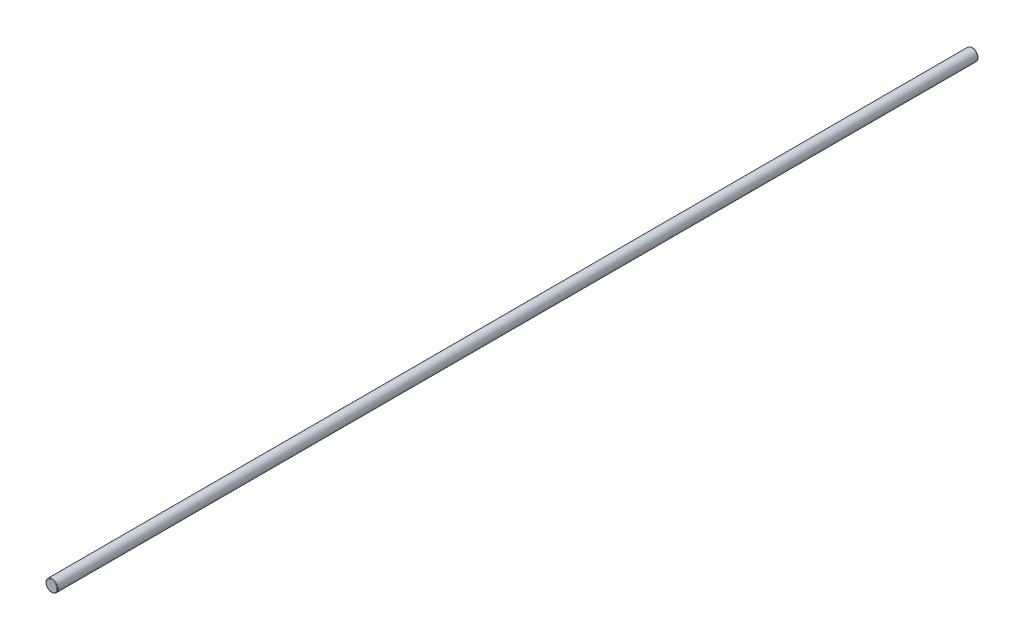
ISO-10303-21;
HEADER;
FILE_DESCRIPTION(('STEP AP214'),'2;1');
FILE_NAME('part.step','',(''),(''),'','','');
FILE_SCHEMA(('AUTOMOTIVE_DESIGN { 1 0 10303 214 1 1 1 1 }'));
ENDSEC;
DATA;
#1=APPLICATION_CONTEXT('core data for automotive mechanical design processes');
#2=APPLICATION_PROTOCOL_DEFINITION('international standard','automotive_design',2000,#1);
#3=PRODUCT_CONTEXT('',#1,'mechanical');
#4=PRODUCT('Part','Part','',(#3));
#5=PRODUCT_RELATED_PRODUCT_CATEGORY('part','',(#4));
#6=PRODUCT_DEFINITION_FORMATION('','',#4);
#7=PRODUCT_DEFINITION_CONTEXT('part definition',#1,'design');
#8=PRODUCT_DEFINITION('design','',#6,#7);
#9=PRODUCT_DEFINITION_SHAPE('','',#8);
#10=(LENGTH_UNIT() NAMED_UNIT(*) SI_UNIT(.MILLI.,.METRE.));
#11=(NAMED_UNIT(*) PLANE_ANGLE_UNIT() SI_UNIT($,.RADIAN.));
#12=(NAMED_UNIT(*) SI_UNIT($,.STERADIAN.) SOLID_ANGLE_UNIT());
#13=UNCERTAINTY_MEASURE_WITH_UNIT(LENGTH_MEASURE(1.E-05),#10,'distance_accuracy_value','');
#14=(GEOMETRIC_REPRESENTATION_CONTEXT(3) GLOBAL_UNCERTAINTY_ASSIGNED_CONTEXT((#13)) GLOBAL_UNIT_ASSIGNED_CONTEXT((#10,
#11,#12)) REPRESENTATION_CONTEXT('',''));
#15=CARTESIAN_POINT('',(0.,0.,0.));
#16=DIRECTION('',(0.,0.,1.));
#17=DIRECTION('',(1.,0.,0.));
#18=AXIS2_PLACEMENT_3D('',#15,#16,#17);
#19=CARTESIAN_POINT('',(0.,0.,349.));
#20=DIRECTION('',(0.,0.,-1.));
#21=DIRECTION('',(-1.,0.,0.));
#22=AXIS2_PLACEMENT_3D('',#19,#20,#21);
#23=CYLINDRICAL_SURFACE('',#22,2.25);
#24=CARTESIAN_POINT('',(0.,0.,0.199999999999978));
#25=DIRECTION('',(0.,0.,1.));
#26=DIRECTION('',(1.,0.,0.));
#27=AXIS2_PLACEMENT_3D('',#24,#25,#26);
#28=CIRCLE('',#27,2.25);
#29=CARTESIAN_POINT('',(2.25,0.,0.199999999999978));
#30=VERTEX_POINT('',#29);
#31=EDGE_CURVE('E39',#30,#30,#28,.T.);
#32=ORIENTED_EDGE('',*,*,#31,.T.);
#33=EDGE_LOOP('',(#32));
#34=FACE_BOUND('',#33,.T.);
#35=CARTESIAN_POINT('',(0.,0.,348.8));
#36=DIRECTION('',(0.,0.,1.));
#37=DIRECTION('',(1.,0.,0.));
#38=AXIS2_PLACEMENT_3D('',#35,#36,#37);
#39=CIRCLE('',#38,2.25);
#40=CARTESIAN_POINT('',(2.25,0.,348.8));
#41=VERTEX_POINT('',#40);
#42=EDGE_CURVE('E43',#41,#41,#39,.F.);
#43=ORIENTED_EDGE('',*,*,#42,.T.);
#44=EDGE_LOOP('',(#43));
#45=FACE_BOUND('',#44,.T.);
#46=ADVANCED_FACE('F29',(#34,#45),#23,.T.);
#47=CARTESIAN_POINT('',(0.,0.,349.));
#48=DIRECTION('',(0.,0.,1.));
#49=DIRECTION('',(1.,0.,0.));
#50=AXIS2_PLACEMENT_3D('',#47,#48,#49);
#51=PLANE('',#50);
#52=CARTESIAN_POINT('',(0.,0.,349.));
#53=DIRECTION('',(0.,0.,1.));
#54=DIRECTION('',(1.,0.,0.));
#55=AXIS2_PLACEMENT_3D('',#52,#53,#54);
#56=CIRCLE('',#55,2.05);
#57=CARTESIAN_POINT('',(2.05,0.,349.));
#58=VERTEX_POINT('',#57);
#59=EDGE_CURVE('E10',#58,#58,#56,.T.);
#60=ORIENTED_EDGE('',*,*,#59,.T.);
#61=EDGE_LOOP('',(#60));
#62=FACE_BOUND('',#61,.T.);
#63=ADVANCED_FACE('F62',(#62),#51,.T.);
#64=CARTESIAN_POINT('',(0.,0.,0.));
#65=DIRECTION('',(0.,0.,1.));
#66=DIRECTION('',(1.,0.,0.));
#67=AXIS2_PLACEMENT_3D('',#64,#65,#66);
#68=PLANE('',#67);
#69=CARTESIAN_POINT('',(0.,0.,0.));
#70=DIRECTION('',(0.,0.,1.));
#71=DIRECTION('',(1.,0.,0.));
#72=AXIS2_PLACEMENT_3D('',#69,#70,#71);
#73=CIRCLE('',#72,2.05);
#74=CARTESIAN_POINT('',(2.05,0.,0.));
#75=VERTEX_POINT('',#74);
#76=EDGE_CURVE('E35',#75,#75,#73,.F.);
#77=ORIENTED_EDGE('',*,*,#76,.T.);
#78=EDGE_LOOP('',(#77));
#79=FACE_BOUND('',#78,.T.);
#80=ADVANCED_FACE('F58',(#79),#68,.F.);
#81=CARTESIAN_POINT('',(0.,0.,0.199999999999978));
#82=DIRECTION('',(0.,0.,1.));
#83=DIRECTION('',(1.,0.,0.));
#84=AXIS2_PLACEMENT_3D('',#81,#82,#83);
#85=TOROIDAL_SURFACE('',#84,2.05,0.2);
#86=ORIENTED_EDGE('',*,*,#76,.F.);
#87=EDGE_LOOP('',(#86));
#88=FACE_BOUND('',#87,.T.);
#89=ORIENTED_EDGE('',*,*,#31,.F.);
#90=EDGE_LOOP('',(#89));
#91=FACE_BOUND('',#90,.T.);
#92=ADVANCED_FACE('F53',(#88,#91),#85,.T.);
#93=CARTESIAN_POINT('',(0.,0.,348.8));
#94=DIRECTION('',(0.,0.,1.));
#95=DIRECTION('',(1.,0.,0.));
#96=AXIS2_PLACEMENT_3D('',#93,#94,#95);
#97=TOROIDAL_SURFACE('',#96,2.05,0.2);
#98=ORIENTED_EDGE('',*,*,#42,.F.);
#99=EDGE_LOOP('',(#98));
#100=FACE_BOUND('',#99,.T.);
#101=ORIENTED_EDGE('',*,*,#59,.F.);
#102=EDGE_LOOP('',(#101));
#103=FACE_BOUND('',#102,.T.);
#104=ADVANCED_FACE('F50',(#100,#103),#97,.T.);
#105=CLOSED_SHELL('',(#46,#63,#80,#92,#104));
#106=MANIFOLD_SOLID_BREP('B2',#105);
#107=ADVANCED_BREP_SHAPE_REPRESENTATION('',(#18,#106),#14);
#108=SHAPE_DEFINITION_REPRESENTATION(#9,#107);
ENDSEC;
END-ISO-10303-21;
